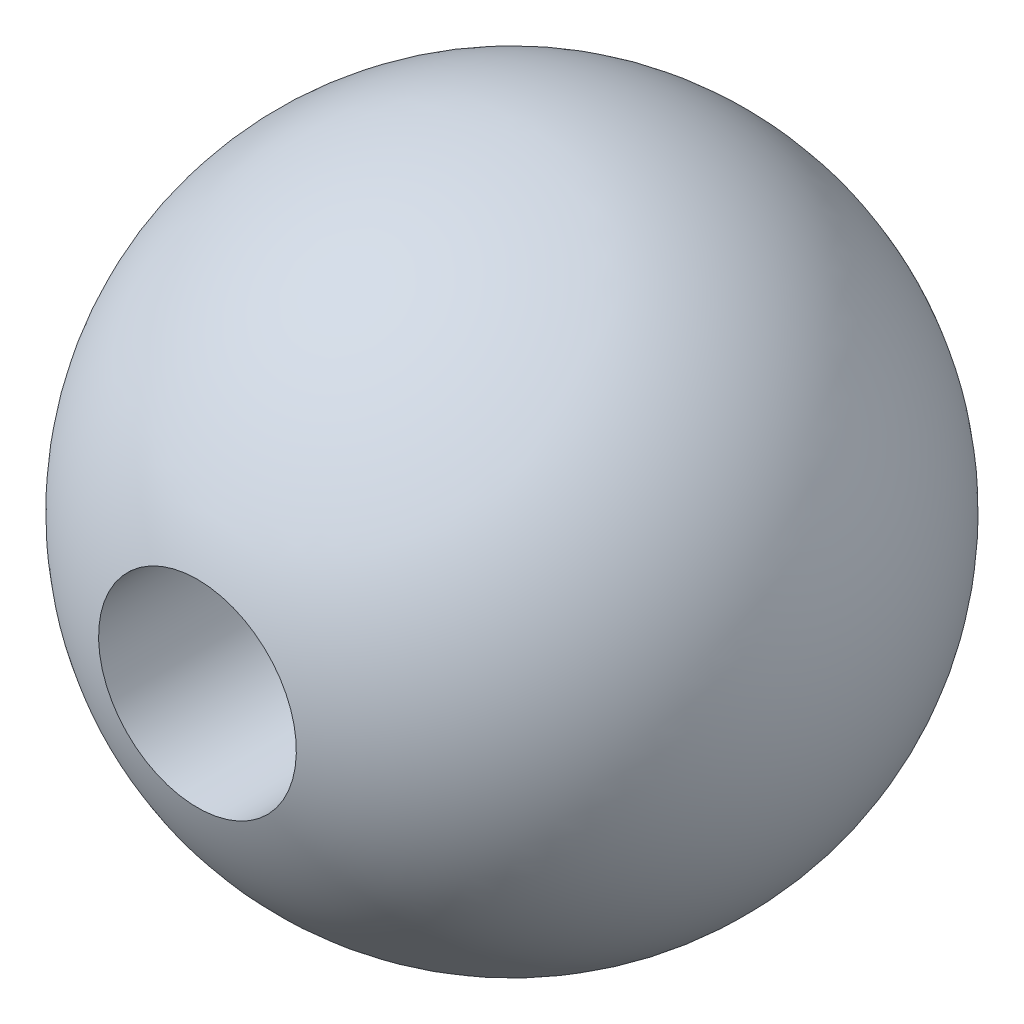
from build123d import *

# Parameters (mm, degrees)
CORTAR_EXTRUIR1_DEPTH      = 87.602540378
CORTAR_EXTRUIR1_DEPTH_BACK = 87.602540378
CROQUIS2_R                 = 15


with BuildPart() as part:
    # Croquis1 → Revoluci_n1 (revolve)
    with BuildSketch(Plane(origin=(0, 0, 0), x_dir=(0, 0, -1), z_dir=(1, 0, 0))):
        with BuildLine():
            Line((-50, 0), (50, 0))
            ThreePointArc((50, 0), (0, 50), (-50, 0))
        make_face()
    revolve(axis=Axis((0, 0, 64.180790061), (0, 0, -1)))

    # Croquis2 → Cortar-Extruir1 (cut, two sides: drawn at the far end of the back side and taken through both)
    with BuildSketch(Plane.XY.offset(-CORTAR_EXTRUIR1_DEPTH_BACK)):
        with Locations(Location((0, 0, 0), (0, 0, 90))):
            Circle(CROQUIS2_R)
    extrude(amount=CORTAR_EXTRUIR1_DEPTH + CORTAR_EXTRUIR1_DEPTH_BACK, mode=Mode.SUBTRACT)


solid = part.part
